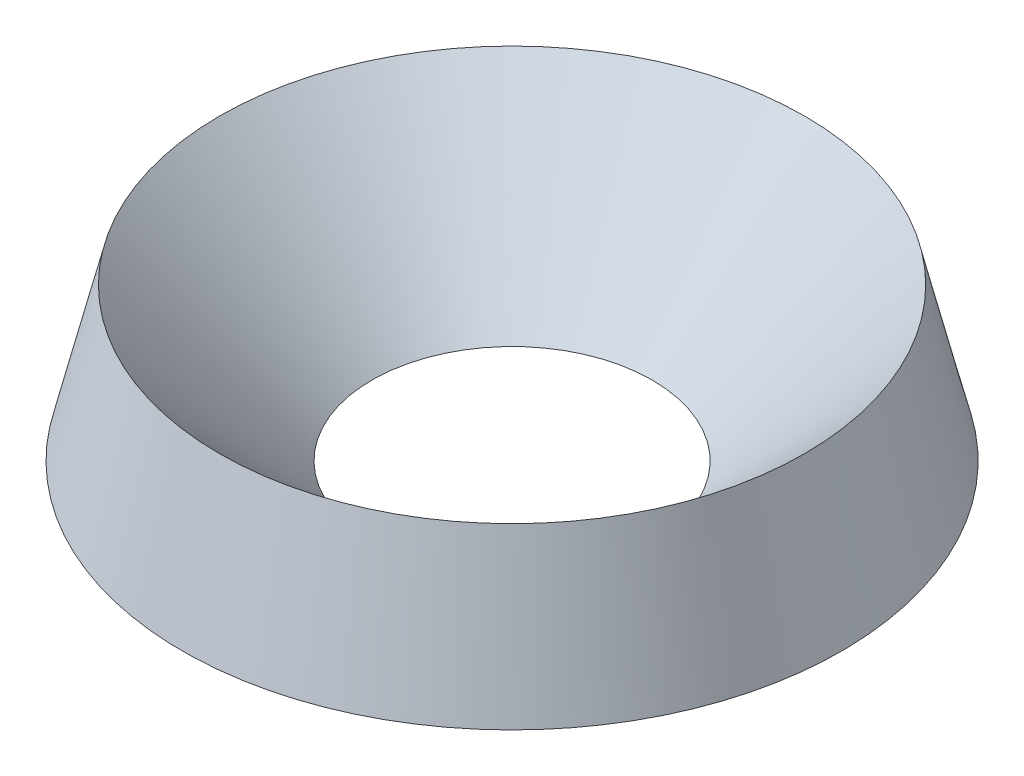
from build123d import *


with BuildPart() as part:
    # Esquisse1 → R_volution1 (revolve)
    with BuildSketch(Plane.XY, mode=Mode.PRIVATE) as r_volution1_sk:
        Polygon((8, 0), (3.4, 0), (7.1, 3.7), align=None)
    revolve(r_volution1_sk.sketch.rotate(Axis((0, 0, 0), (0, 1, 0)), 90), axis=Axis((0, 0, 0), (0, 1, 0)))


solid = part.part
